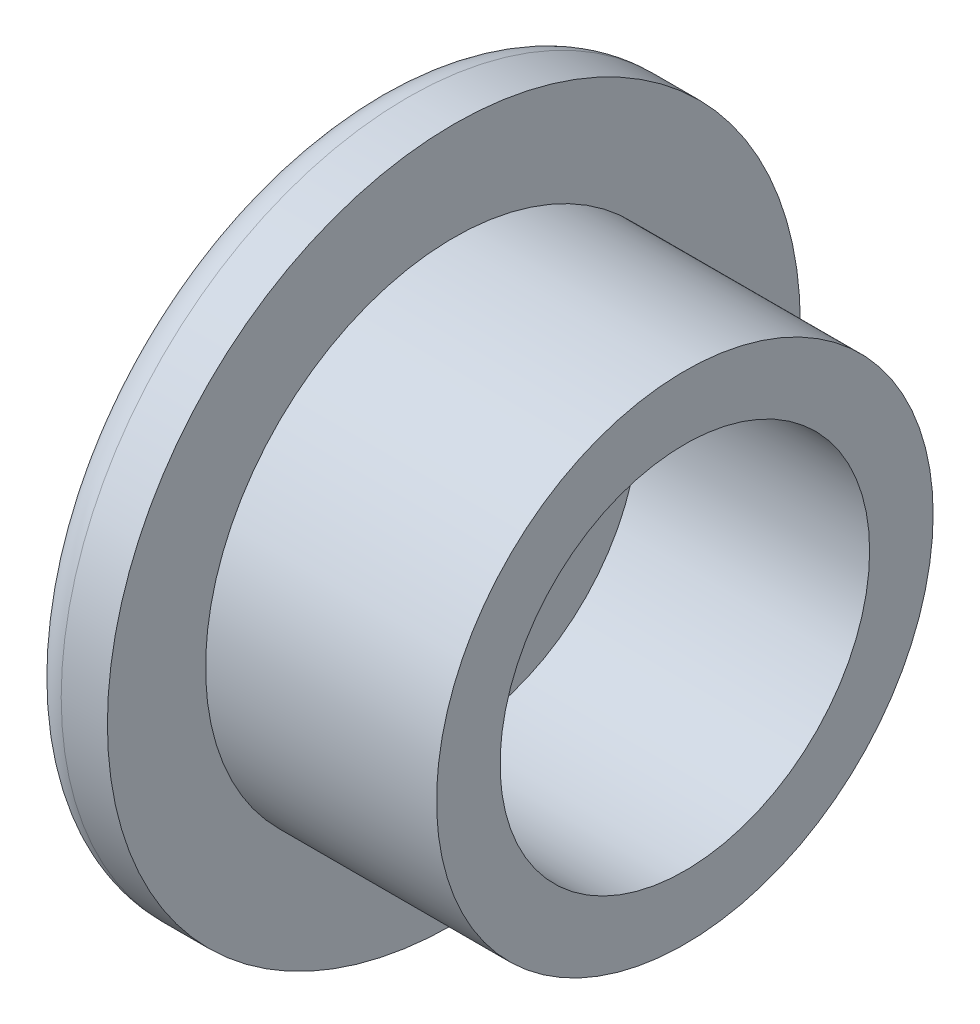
from build123d import *

# Parameters (mm, degrees)
SKETCH1_R           = 10.75
SKETCH1_R_2         = 8
BOSS_EXTRUDE1_DEPTH = 10
SKETCH2_R           = 15
BOSS_EXTRUDE2_DEPTH = 3.5
FILLET1_R           = 1.5


with BuildPart() as part:
    # Sketch1 → Boss-Extrude1 (new body)
    with BuildSketch(Plane(origin=(0, 0, 0), x_dir=(0, 0, -1), z_dir=(1, 0, 0))):
        Circle(SKETCH1_R)
        Circle(SKETCH1_R_2, mode=Mode.SUBTRACT)
    extrude(amount=BOSS_EXTRUDE1_DEPTH)

    # Sketch2 → Boss-Extrude2 (add)
    with BuildSketch(Plane.ZY):
        Circle(SKETCH2_R)
    extrude(amount=BOSS_EXTRUDE2_DEPTH)

    # Fillet1
    fillet1_edges = [part.edges().sort_by_distance(p)[0] for p in [
        (-3.5, 0, -15),
    ]]
    fillet(fillet1_edges, radius=FILLET1_R)


solid = part.part
